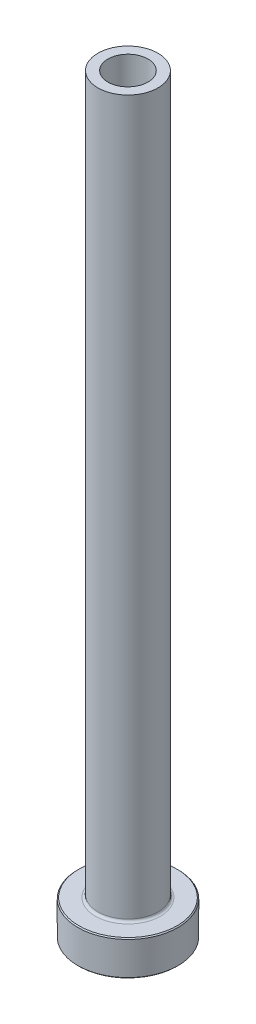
ISO-10303-21;
HEADER;
FILE_DESCRIPTION(('STEP AP214'),'2;1');
FILE_NAME('part.step','',(''),(''),'','','');
FILE_SCHEMA(('AUTOMOTIVE_DESIGN { 1 0 10303 214 1 1 1 1 }'));
ENDSEC;
DATA;
#1=APPLICATION_CONTEXT('core data for automotive mechanical design processes');
#2=APPLICATION_PROTOCOL_DEFINITION('international standard','automotive_design',2000,#1);
#3=PRODUCT_CONTEXT('',#1,'mechanical');
#4=PRODUCT('Part','Part','',(#3));
#5=PRODUCT_RELATED_PRODUCT_CATEGORY('part','',(#4));
#6=PRODUCT_DEFINITION_FORMATION('','',#4);
#7=PRODUCT_DEFINITION_CONTEXT('part definition',#1,'design');
#8=PRODUCT_DEFINITION('design','',#6,#7);
#9=PRODUCT_DEFINITION_SHAPE('','',#8);
#10=(LENGTH_UNIT() NAMED_UNIT(*) SI_UNIT(.MILLI.,.METRE.));
#11=(NAMED_UNIT(*) PLANE_ANGLE_UNIT() SI_UNIT($,.RADIAN.));
#12=(NAMED_UNIT(*) SI_UNIT($,.STERADIAN.) SOLID_ANGLE_UNIT());
#13=UNCERTAINTY_MEASURE_WITH_UNIT(LENGTH_MEASURE(1.E-05),#10,'distance_accuracy_value','');
#14=(GEOMETRIC_REPRESENTATION_CONTEXT(3) GLOBAL_UNCERTAINTY_ASSIGNED_CONTEXT((#13)) GLOBAL_UNIT_ASSIGNED_CONTEXT((#10,
#11,#12)) REPRESENTATION_CONTEXT('',''));
#15=CARTESIAN_POINT('',(0.,0.,0.));
#16=DIRECTION('',(0.,0.,1.));
#17=DIRECTION('',(1.,0.,0.));
#18=AXIS2_PLACEMENT_3D('',#15,#16,#17);
#19=CARTESIAN_POINT('',(0.,92.1876809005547,0.));
#20=DIRECTION('',(0.,1.,0.));
#21=DIRECTION('',(0.,0.,1.));
#22=AXIS2_PLACEMENT_3D('',#19,#20,#21);
#23=CYLINDRICAL_SURFACE('',#22,4.);
#24=CARTESIAN_POINT('',(0.,150.,0.));
#25=DIRECTION('',(0.,1.,0.));
#26=DIRECTION('',(0.,0.,1.));
#27=AXIS2_PLACEMENT_3D('',#24,#25,#26);
#28=CIRCLE('',#27,4.);
#29=CARTESIAN_POINT('',(0.,150.,4.));
#30=VERTEX_POINT('',#29);
#31=EDGE_CURVE('E62',#30,#30,#28,.T.);
#32=ORIENTED_EDGE('',*,*,#31,.T.);
#33=EDGE_LOOP('',(#32));
#34=FACE_BOUND('',#33,.T.);
#35=CARTESIAN_POINT('',(0.,105.,0.));
#36=DIRECTION('',(0.,1.,0.));
#37=DIRECTION('',(0.,0.,1.));
#38=AXIS2_PLACEMENT_3D('',#35,#36,#37);
#39=CIRCLE('',#38,4.);
#40=CARTESIAN_POINT('',(0.,105.,4.));
#41=VERTEX_POINT('',#40);
#42=EDGE_CURVE('E71',#41,#41,#39,.T.);
#43=ORIENTED_EDGE('',*,*,#42,.F.);
#44=EDGE_LOOP('',(#43));
#45=FACE_BOUND('',#44,.T.);
#46=ADVANCED_FACE('F30',(#34,#45),#23,.F.);
#47=CARTESIAN_POINT('',(-4.,150.,0.));
#48=DIRECTION('',(0.,1.,0.));
#49=DIRECTION('',(0.,0.,1.));
#50=AXIS2_PLACEMENT_3D('',#47,#48,#49);
#51=PLANE('',#50);
#52=CARTESIAN_POINT('',(0.,150.,0.));
#53=DIRECTION('',(0.,1.,0.));
#54=DIRECTION('',(0.,0.,1.));
#55=AXIS2_PLACEMENT_3D('',#52,#53,#54);
#56=CIRCLE('',#55,6.00000000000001);
#57=CARTESIAN_POINT('',(0.,150.,6.00000000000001));
#58=VERTEX_POINT('',#57);
#59=EDGE_CURVE('E65',#58,#58,#56,.T.);
#60=ORIENTED_EDGE('',*,*,#59,.T.);
#61=EDGE_LOOP('',(#60));
#62=FACE_BOUND('',#61,.T.);
#63=ORIENTED_EDGE('',*,*,#31,.F.);
#64=EDGE_LOOP('',(#63));
#65=FACE_BOUND('',#64,.T.);
#66=ADVANCED_FACE('F79',(#62,#65),#51,.T.);
#67=CARTESIAN_POINT('',(0.,92.1876809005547,0.));
#68=DIRECTION('',(0.,1.,0.));
#69=DIRECTION('',(0.,0.,1.));
#70=AXIS2_PLACEMENT_3D('',#67,#68,#69);
#71=CYLINDRICAL_SURFACE('',#70,6.);
#72=CARTESIAN_POINT('',(0.,7.50000000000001,0.));
#73=DIRECTION('',(0.,1.,0.));
#74=DIRECTION('',(0.,0.,1.));
#75=AXIS2_PLACEMENT_3D('',#72,#73,#74);
#76=CIRCLE('',#75,6.);
#77=CARTESIAN_POINT('',(0.,7.50000000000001,6.));
#78=VERTEX_POINT('',#77);
#79=EDGE_CURVE('E59',#78,#78,#76,.T.);
#80=ORIENTED_EDGE('',*,*,#79,.T.);
#81=EDGE_LOOP('',(#80));
#82=FACE_BOUND('',#81,.T.);
#83=ORIENTED_EDGE('',*,*,#59,.F.);
#84=EDGE_LOOP('',(#83));
#85=FACE_BOUND('',#84,.T.);
#86=ADVANCED_FACE('F85',(#82,#85),#71,.T.);
#87=CARTESIAN_POINT('',(-5.99999999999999,7.,0.));
#88=DIRECTION('',(0.,1.,0.));
#89=DIRECTION('',(0.,0.,1.));
#90=AXIS2_PLACEMENT_3D('',#87,#88,#89);
#91=PLANE('',#90);
#92=CARTESIAN_POINT('',(0.,7.,0.));
#93=DIRECTION('',(0.,1.,0.));
#94=DIRECTION('',(0.,0.,1.));
#95=AXIS2_PLACEMENT_3D('',#92,#93,#94);
#96=CIRCLE('',#95,9.79999999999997);
#97=CARTESIAN_POINT('',(0.,7.,9.79999999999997));
#98=VERTEX_POINT('',#97);
#99=EDGE_CURVE('E53',#98,#98,#96,.T.);
#100=ORIENTED_EDGE('',*,*,#99,.T.);
#101=EDGE_LOOP('',(#100));
#102=FACE_BOUND('',#101,.T.);
#103=CARTESIAN_POINT('',(0.,7.,0.));
#104=DIRECTION('',(0.,1.,0.));
#105=DIRECTION('',(0.,0.,1.));
#106=AXIS2_PLACEMENT_3D('',#103,#104,#105);
#107=CIRCLE('',#106,6.5);
#108=CARTESIAN_POINT('',(0.,7.,6.5));
#109=VERTEX_POINT('',#108);
#110=EDGE_CURVE('E56',#109,#109,#107,.F.);
#111=ORIENTED_EDGE('',*,*,#110,.T.);
#112=EDGE_LOOP('',(#111));
#113=FACE_BOUND('',#112,.T.);
#114=ADVANCED_FACE('F111',(#102,#113),#91,.T.);
#115=CARTESIAN_POINT('',(0.,92.1876809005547,0.));
#116=DIRECTION('',(0.,1.,0.));
#117=DIRECTION('',(0.,0.,1.));
#118=AXIS2_PLACEMENT_3D('',#115,#116,#117);
#119=CYLINDRICAL_SURFACE('',#118,9.99999999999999);
#120=CARTESIAN_POINT('',(0.,6.79999999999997,0.));
#121=DIRECTION('',(0.,1.,0.));
#122=DIRECTION('',(0.,0.,1.));
#123=AXIS2_PLACEMENT_3D('',#120,#121,#122);
#124=CIRCLE('',#123,9.99999999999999);
#125=CARTESIAN_POINT('',(0.,6.79999999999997,9.99999999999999));
#126=VERTEX_POINT('',#125);
#127=EDGE_CURVE('E45',#126,#126,#124,.F.);
#128=ORIENTED_EDGE('',*,*,#127,.T.);
#129=EDGE_LOOP('',(#128));
#130=FACE_BOUND('',#129,.T.);
#131=CARTESIAN_POINT('',(0.,0.200000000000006,0.));
#132=DIRECTION('',(0.,-1.,0.));
#133=DIRECTION('',(0.,0.,-1.));
#134=AXIS2_PLACEMENT_3D('',#131,#132,#133);
#135=CIRCLE('',#134,9.99999999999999);
#136=CARTESIAN_POINT('',(0.,0.200000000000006,-9.99999999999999));
#137=VERTEX_POINT('',#136);
#138=EDGE_CURVE('E50',#137,#137,#135,.F.);
#139=ORIENTED_EDGE('',*,*,#138,.T.);
#140=EDGE_LOOP('',(#139));
#141=FACE_BOUND('',#140,.T.);
#142=ADVANCED_FACE('F108',(#130,#141),#119,.T.);
#143=CARTESIAN_POINT('',(-9.99999999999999,0.,0.));
#144=DIRECTION('',(0.,-1.,0.));
#145=DIRECTION('',(0.,0.,-1.));
#146=AXIS2_PLACEMENT_3D('',#143,#144,#145);
#147=PLANE('',#146);
#148=CARTESIAN_POINT('',(0.,0.,0.));
#149=DIRECTION('',(0.,-1.,0.));
#150=DIRECTION('',(0.,0.,-1.));
#151=AXIS2_PLACEMENT_3D('',#148,#149,#150);
#152=CIRCLE('',#151,4.74999999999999);
#153=CARTESIAN_POINT('',(0.,0.,-4.74999999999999));
#154=VERTEX_POINT('',#153);
#155=EDGE_CURVE('E37',#154,#154,#152,.F.);
#156=ORIENTED_EDGE('',*,*,#155,.T.);
#157=EDGE_LOOP('',(#156));
#158=FACE_BOUND('',#157,.T.);
#159=CARTESIAN_POINT('',(0.,0.,0.));
#160=DIRECTION('',(0.,-1.,0.));
#161=DIRECTION('',(0.,0.,-1.));
#162=AXIS2_PLACEMENT_3D('',#159,#160,#161);
#163=CIRCLE('',#162,9.79999999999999);
#164=CARTESIAN_POINT('',(0.,0.,-9.79999999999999));
#165=VERTEX_POINT('',#164);
#166=EDGE_CURVE('E41',#165,#165,#163,.T.);
#167=ORIENTED_EDGE('',*,*,#166,.T.);
#168=EDGE_LOOP('',(#167));
#169=FACE_BOUND('',#168,.T.);
#170=ADVANCED_FACE('F110',(#158,#169),#147,.T.);
#171=CARTESIAN_POINT('',(0.,92.1876809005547,0.));
#172=DIRECTION('',(0.,1.,0.));
#173=DIRECTION('',(0.,0.,1.));
#174=AXIS2_PLACEMENT_3D('',#171,#172,#173);
#175=CYLINDRICAL_SURFACE('',#174,4.25);
#176=CARTESIAN_POINT('',(0.,0.5,0.));
#177=DIRECTION('',(0.,-1.,0.));
#178=DIRECTION('',(0.,0.,-1.));
#179=AXIS2_PLACEMENT_3D('',#176,#177,#178);
#180=CIRCLE('',#179,4.25);
#181=CARTESIAN_POINT('',(0.,0.5,-4.25));
#182=VERTEX_POINT('',#181);
#183=EDGE_CURVE('E10',#182,#182,#180,.T.);
#184=ORIENTED_EDGE('',*,*,#183,.T.);
#185=EDGE_LOOP('',(#184));
#186=FACE_BOUND('',#185,.T.);
#187=CARTESIAN_POINT('',(0.,93.,0.));
#188=DIRECTION('',(0.,1.,0.));
#189=DIRECTION('',(0.,0.,1.));
#190=AXIS2_PLACEMENT_3D('',#187,#188,#189);
#191=CIRCLE('',#190,4.25);
#192=CARTESIAN_POINT('',(0.,93.,4.25));
#193=VERTEX_POINT('',#192);
#194=EDGE_CURVE('E68',#193,#193,#191,.T.);
#195=ORIENTED_EDGE('',*,*,#194,.T.);
#196=EDGE_LOOP('',(#195));
#197=FACE_BOUND('',#196,.T.);
#198=ADVANCED_FACE('F118',(#186,#197),#175,.F.);
#199=CARTESIAN_POINT('',(0.,93.,0.));
#200=DIRECTION('',(0.,-1.,0.));
#201=DIRECTION('',(0.,0.,-1.));
#202=AXIS2_PLACEMENT_3D('',#199,#200,#201);
#203=CONICAL_SURFACE('',#202,4.25,0.0208303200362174);
#204=ORIENTED_EDGE('',*,*,#42,.T.);
#205=EDGE_LOOP('',(#204));
#206=FACE_BOUND('',#205,.T.);
#207=ORIENTED_EDGE('',*,*,#194,.F.);
#208=EDGE_LOOP('',(#207));
#209=FACE_BOUND('',#208,.T.);
#210=ADVANCED_FACE('F75',(#206,#209),#203,.F.);
#211=CARTESIAN_POINT('',(0.,7.50000000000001,0.));
#212=DIRECTION('',(0.,1.,0.));
#213=DIRECTION('',(0.,0.,1.));
#214=AXIS2_PLACEMENT_3D('',#211,#212,#213);
#215=TOROIDAL_SURFACE('',#214,6.5,0.5);
#216=ORIENTED_EDGE('',*,*,#110,.F.);
#217=EDGE_LOOP('',(#216));
#218=FACE_BOUND('',#217,.T.);
#219=ORIENTED_EDGE('',*,*,#79,.F.);
#220=EDGE_LOOP('',(#219));
#221=FACE_BOUND('',#220,.T.);
#222=ADVANCED_FACE('F90',(#218,#221),#215,.F.);
#223=CARTESIAN_POINT('',(0.,7.00000000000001,0.));
#224=DIRECTION('',(0.,-1.,0.));
#225=DIRECTION('',(0.,0.,-1.));
#226=AXIS2_PLACEMENT_3D('',#223,#224,#225);
#227=CONICAL_SURFACE('',#226,9.79999999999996,0.785398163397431);
#228=ORIENTED_EDGE('',*,*,#127,.F.);
#229=EDGE_LOOP('',(#228));
#230=FACE_BOUND('',#229,.T.);
#231=ORIENTED_EDGE('',*,*,#99,.F.);
#232=EDGE_LOOP('',(#231));
#233=FACE_BOUND('',#232,.T.);
#234=ADVANCED_FACE('F93',(#230,#233),#227,.T.);
#235=CARTESIAN_POINT('',(0.,0.200000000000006,0.));
#236=DIRECTION('',(0.,1.,0.));
#237=DIRECTION('',(0.,0.,1.));
#238=AXIS2_PLACEMENT_3D('',#235,#236,#237);
#239=CONICAL_SURFACE('',#238,9.99999999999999,0.785398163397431);
#240=ORIENTED_EDGE('',*,*,#166,.F.);
#241=EDGE_LOOP('',(#240));
#242=FACE_BOUND('',#241,.T.);
#243=ORIENTED_EDGE('',*,*,#138,.F.);
#244=EDGE_LOOP('',(#243));
#245=FACE_BOUND('',#244,.T.);
#246=ADVANCED_FACE('F96',(#242,#245),#239,.T.);
#247=CARTESIAN_POINT('',(0.,0.,0.));
#248=DIRECTION('',(0.,-1.,0.));
#249=DIRECTION('',(0.,0.,-1.));
#250=AXIS2_PLACEMENT_3D('',#247,#248,#249);
#251=CONICAL_SURFACE('',#250,4.74999999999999,0.785398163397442);
#252=ORIENTED_EDGE('',*,*,#183,.F.);
#253=EDGE_LOOP('',(#252));
#254=FACE_BOUND('',#253,.T.);
#255=ORIENTED_EDGE('',*,*,#155,.F.);
#256=EDGE_LOOP('',(#255));
#257=FACE_BOUND('',#256,.T.);
#258=ADVANCED_FACE('F32',(#254,#257),#251,.F.);
#259=CLOSED_SHELL('',(#46,#66,#86,#114,#142,#170,#198,#210,#222,#234,#246,#258));
#260=MANIFOLD_SOLID_BREP('B2',#259);
#261=ADVANCED_BREP_SHAPE_REPRESENTATION('',(#18,#260),#14);
#262=SHAPE_DEFINITION_REPRESENTATION(#9,#261);
ENDSEC;
END-ISO-10303-21;
